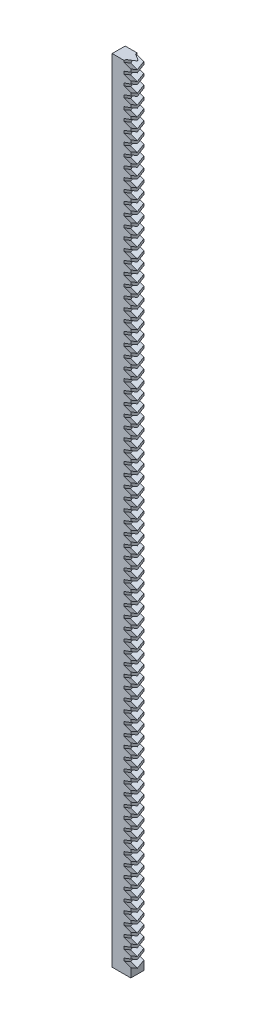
from build123d import *

# Parameters (mm, degrees)
SKETCH2_W           = 10
SKETCH2_H           = 425
BOSS_EXTRUDE2_DEPTH = 3.5
LPATTERN2_COUNT     = 77
LPATTERN2_PITCH     = 5.5


with BuildPart() as part:
    # Sketch2 → Boss-Extrude2 (new, symmetric)
    with BuildSketch(Plane.XY):
        with Locations((-3.25, 204.9726196)):
            Rectangle(SKETCH2_W, SKETCH2_H)
    extrude(amount=BOSS_EXTRUDE2_DEPTH, both=True)

    # Sketch4 → Cut-Loft1 section 0
    with BuildSketch(Plane.XY):
        with BuildLine():
            Line((1.75, -0.7374989), (-1.8, -2.0295932))
            Line((-1.8, -2.0295932), (-1.8, -3.4681939))
            Line((-1.8, -3.4681939), (1.75, -4.7602883))
            Line((1.75, -4.7602883), (1.75, -0.7374989))
        make_face()
    # Sketch6 → Cut-Loft1 section 1
    with BuildSketch(Plane(origin=(0, 2.020725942, 3.5), x_dir=(1, 0, 0), z_dir=(0, 0, 1))):
        with BuildLine():
            Line((1.75, -0.7374989), (-1.8, -2.0295932))
            Line((-1.8, -2.0295932), (-1.8, -3.4681939))
            Line((-1.8, -3.4681939), (1.75, -4.7602883))
            Line((1.75, -4.7602883), (1.75, -0.7374989))
        make_face()
    cut_loft1 = loft(mode=Mode.SUBTRACT)

    # Sketch4_3 → Cut-Loft2 section 0
    with BuildSketch(Plane.XY):
        with BuildLine():
            Line((1.75, -0.7374989), (-1.8, -2.0295932))
            Line((-1.8, -2.0295932), (-1.8, -3.4681939))
            Line((-1.8, -3.4681939), (1.75, -4.7602883))
            Line((1.75, -4.7602883), (1.75, -0.7374989))
        make_face()
    # Sketch7 → Cut-Loft2 section 1
    with BuildSketch(Plane(origin=(0, 2.020725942, -3.5), x_dir=(1, 0, 0), z_dir=(0, 0, 1))):
        with BuildLine():
            Line((1.75, -0.7374989), (-1.8, -2.0295932))
            Line((-1.8, -2.0295932), (-1.8, -3.4681939))
            Line((-1.8, -3.4681939), (1.75, -4.7602883))
            Line((1.75, -4.7602883), (1.75, -0.7374989))
        make_face()
    cut_loft2 = loft(mode=Mode.SUBTRACT)

    # LPattern2: Cut-Loft1, Cut-Loft2 ×77
    with Locations(*[(0, i * LPATTERN2_PITCH, 0) for i in range(1, LPATTERN2_COUNT)]):
        add(cut_loft1, mode=Mode.SUBTRACT)
        add(cut_loft2, mode=Mode.SUBTRACT)


solid = part.part
